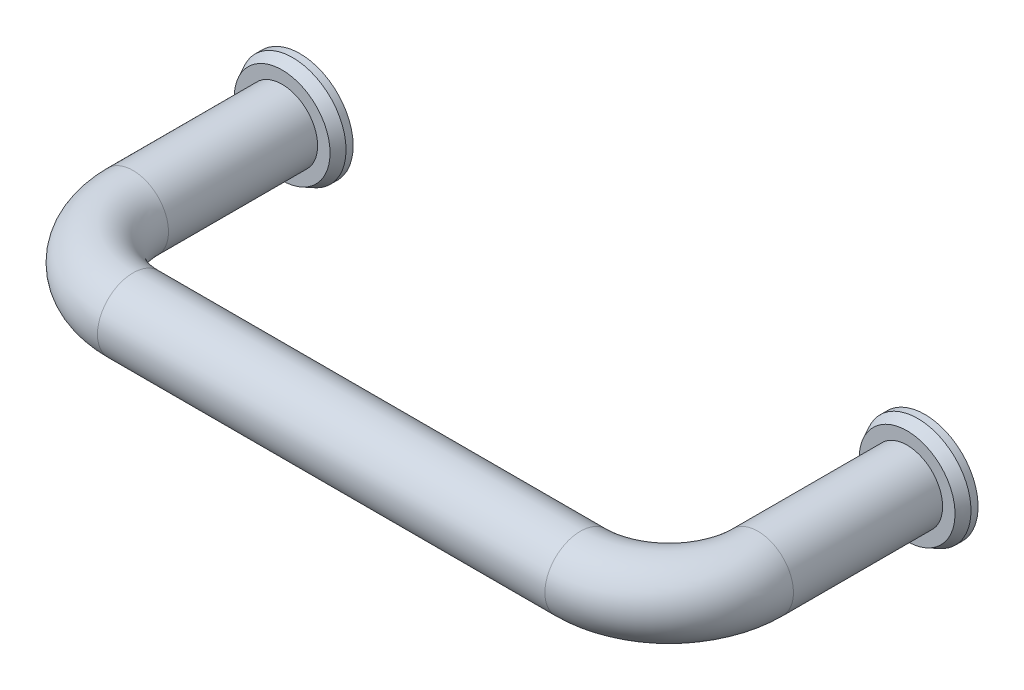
ISO-10303-21;
HEADER;
FILE_DESCRIPTION(('STEP AP214'),'2;1');
FILE_NAME('part.step','',(''),(''),'','','');
FILE_SCHEMA(('AUTOMOTIVE_DESIGN { 1 0 10303 214 1 1 1 1 }'));
ENDSEC;
DATA;
#1=APPLICATION_CONTEXT('core data for automotive mechanical design processes');
#2=APPLICATION_PROTOCOL_DEFINITION('international standard','automotive_design',2000,#1);
#3=PRODUCT_CONTEXT('',#1,'mechanical');
#4=PRODUCT('Part','Part','',(#3));
#5=PRODUCT_RELATED_PRODUCT_CATEGORY('part','',(#4));
#6=PRODUCT_DEFINITION_FORMATION('','',#4);
#7=PRODUCT_DEFINITION_CONTEXT('part definition',#1,'design');
#8=PRODUCT_DEFINITION('design','',#6,#7);
#9=PRODUCT_DEFINITION_SHAPE('','',#8);
#10=(LENGTH_UNIT() NAMED_UNIT(*) SI_UNIT(.MILLI.,.METRE.));
#11=(NAMED_UNIT(*) PLANE_ANGLE_UNIT() SI_UNIT($,.RADIAN.));
#12=(NAMED_UNIT(*) SI_UNIT($,.STERADIAN.) SOLID_ANGLE_UNIT());
#13=UNCERTAINTY_MEASURE_WITH_UNIT(LENGTH_MEASURE(1.E-05),#10,'distance_accuracy_value','');
#14=(GEOMETRIC_REPRESENTATION_CONTEXT(3) GLOBAL_UNCERTAINTY_ASSIGNED_CONTEXT((#13)) GLOBAL_UNIT_ASSIGNED_CONTEXT((#10,
#11,#12)) REPRESENTATION_CONTEXT('',''));
#15=CARTESIAN_POINT('',(0.,0.,0.));
#16=DIRECTION('',(0.,0.,1.));
#17=DIRECTION('',(1.,0.,0.));
#18=AXIS2_PLACEMENT_3D('',#15,#16,#17);
#19=CARTESIAN_POINT('',(0.,0.,0.));
#20=DIRECTION('',(0.,0.,-1.));
#21=DIRECTION('',(0.,1.,0.));
#22=AXIS2_PLACEMENT_3D('',#19,#20,#21);
#23=PLANE('',#22);
#24=CARTESIAN_POINT('',(0.,0.,0.));
#25=DIRECTION('',(0.,0.,1.));
#26=DIRECTION('',(1.,0.,0.));
#27=AXIS2_PLACEMENT_3D('',#24,#25,#26);
#28=CIRCLE('',#27,7.5);
#29=CARTESIAN_POINT('',(7.5,0.,0.));
#30=VERTEX_POINT('',#29);
#31=EDGE_CURVE('E56',#30,#30,#28,.T.);
#32=ORIENTED_EDGE('',*,*,#31,.F.);
#33=EDGE_LOOP('',(#32));
#34=FACE_BOUND('',#33,.T.);
#35=CARTESIAN_POINT('',(0.,0.,0.));
#36=DIRECTION('',(0.,0.,1.));
#37=DIRECTION('',(0.,-1.,0.));
#38=AXIS2_PLACEMENT_3D('',#35,#36,#37);
#39=CIRCLE('',#38,2.5);
#40=CARTESIAN_POINT('',(0.,-2.5,0.));
#41=VERTEX_POINT('',#40);
#42=EDGE_CURVE('E62',#41,#41,#39,.T.);
#43=ORIENTED_EDGE('',*,*,#42,.T.);
#44=EDGE_LOOP('',(#43));
#45=FACE_BOUND('',#44,.T.);
#46=ADVANCED_FACE('F12',(#34,#45),#23,.T.);
#47=CARTESIAN_POINT('',(0.,0.,23.5));
#48=DIRECTION('',(0.,0.,-1.));
#49=DIRECTION('',(0.,-1.,0.));
#50=AXIS2_PLACEMENT_3D('',#47,#48,#49);
#51=CYLINDRICAL_SURFACE('',#50,5.);
#52=CARTESIAN_POINT('',(0.,0.,23.5));
#53=DIRECTION('',(0.,0.,-1.));
#54=DIRECTION('',(0.,1.,0.));
#55=AXIS2_PLACEMENT_3D('',#52,#53,#54);
#56=CIRCLE('',#55,5.);
#57=CARTESIAN_POINT('',(-5.,0.,23.5));
#58=VERTEX_POINT('',#57);
#59=EDGE_CURVE('E20',#58,#58,#56,.T.);
#60=ORIENTED_EDGE('',*,*,#59,.T.);
#61=EDGE_LOOP('',(#60));
#62=FACE_BOUND('',#61,.T.);
#63=CARTESIAN_POINT('',(0.,0.,2.5));
#64=DIRECTION('',(0.,0.,-1.));
#65=DIRECTION('',(-1.,0.,0.));
#66=AXIS2_PLACEMENT_3D('',#63,#64,#65);
#67=CIRCLE('',#66,5.);
#68=CARTESIAN_POINT('',(-5.,0.,2.50000000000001));
#69=VERTEX_POINT('',#68);
#70=EDGE_CURVE('E16',#69,#69,#67,.F.);
#71=ORIENTED_EDGE('',*,*,#70,.T.);
#72=EDGE_LOOP('',(#71));
#73=FACE_BOUND('',#72,.T.);
#74=ADVANCED_FACE('F14',(#62,#73),#51,.T.);
#75=CARTESIAN_POINT('',(88.,0.,23.5));
#76=DIRECTION('',(0.,0.,-1.));
#77=DIRECTION('',(0.,-1.,0.));
#78=AXIS2_PLACEMENT_3D('',#75,#76,#77);
#79=CYLINDRICAL_SURFACE('',#78,5.);
#80=CARTESIAN_POINT('',(88.,0.,23.5));
#81=DIRECTION('',(0.,0.,1.));
#82=DIRECTION('',(0.,1.,0.));
#83=AXIS2_PLACEMENT_3D('',#80,#81,#82);
#84=CIRCLE('',#83,5.);
#85=CARTESIAN_POINT('',(93.,0.,23.5));
#86=VERTEX_POINT('',#85);
#87=EDGE_CURVE('E32',#86,#86,#84,.T.);
#88=ORIENTED_EDGE('',*,*,#87,.F.);
#89=EDGE_LOOP('',(#88));
#90=FACE_BOUND('',#89,.T.);
#91=CARTESIAN_POINT('',(88.,0.,2.5));
#92=DIRECTION('',(0.,0.,-1.));
#93=DIRECTION('',(-1.,0.,0.));
#94=AXIS2_PLACEMENT_3D('',#91,#92,#93);
#95=CIRCLE('',#94,5.);
#96=CARTESIAN_POINT('',(83.,0.,2.49999999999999));
#97=VERTEX_POINT('',#96);
#98=EDGE_CURVE('E8',#97,#97,#95,.T.);
#99=ORIENTED_EDGE('',*,*,#98,.F.);
#100=EDGE_LOOP('',(#99));
#101=FACE_BOUND('',#100,.T.);
#102=ADVANCED_FACE('F91',(#90,#101),#79,.T.);
#103=CARTESIAN_POINT('',(12.5,0.,23.5));
#104=DIRECTION('',(0.,-1.,0.));
#105=DIRECTION('',(1.,0.,0.));
#106=AXIS2_PLACEMENT_3D('',#103,#104,#105);
#107=TOROIDAL_SURFACE('',#106,12.5,5.);
#108=CARTESIAN_POINT('',(12.5,0.,36.));
#109=DIRECTION('',(-1.,0.,0.));
#110=DIRECTION('',(0.,1.,0.));
#111=AXIS2_PLACEMENT_3D('',#108,#109,#110);
#112=CIRCLE('',#111,5.);
#113=CARTESIAN_POINT('',(12.5,0.,41.));
#114=VERTEX_POINT('',#113);
#115=EDGE_CURVE('E24',#114,#114,#112,.T.);
#116=CARTESIAN_POINT('',(12.5,0.,23.5));
#117=DIRECTION('',(0.,-1.,0.));
#118=DIRECTION('',(1.,0.,0.));
#119=AXIS2_PLACEMENT_3D('',#116,#117,#118);
#120=CIRCLE('',#119,17.5);
#121=EDGE_CURVE('',#114,#58,#120,.T.);
#122=ORIENTED_EDGE('',*,*,#115,.T.);
#123=ORIENTED_EDGE('',*,*,#59,.F.);
#124=ORIENTED_EDGE('',*,*,#121,.T.);
#125=ORIENTED_EDGE('',*,*,#121,.F.);
#126=EDGE_LOOP('',(#122,#124,#123,#125));
#127=FACE_BOUND('',#126,.T.);
#128=ADVANCED_FACE('F100',(#127),#107,.T.);
#129=CARTESIAN_POINT('',(75.5,0.,36.));
#130=DIRECTION('',(-1.,0.,0.));
#131=DIRECTION('',(0.,-1.,0.));
#132=AXIS2_PLACEMENT_3D('',#129,#130,#131);
#133=CYLINDRICAL_SURFACE('',#132,5.);
#134=CARTESIAN_POINT('',(75.5,0.,36.));
#135=DIRECTION('',(-1.,0.,0.));
#136=DIRECTION('',(0.,1.,0.));
#137=AXIS2_PLACEMENT_3D('',#134,#135,#136);
#138=CIRCLE('',#137,5.);
#139=CARTESIAN_POINT('',(75.5,0.,41.));
#140=VERTEX_POINT('',#139);
#141=EDGE_CURVE('E29',#140,#140,#138,.T.);
#142=ORIENTED_EDGE('',*,*,#141,.T.);
#143=EDGE_LOOP('',(#142));
#144=FACE_BOUND('',#143,.T.);
#145=ORIENTED_EDGE('',*,*,#115,.F.);
#146=EDGE_LOOP('',(#145));
#147=FACE_BOUND('',#146,.T.);
#148=ADVANCED_FACE('F106',(#144,#147),#133,.T.);
#149=CARTESIAN_POINT('',(75.5,0.,23.5));
#150=DIRECTION('',(0.,-1.,0.));
#151=DIRECTION('',(1.,0.,0.));
#152=AXIS2_PLACEMENT_3D('',#149,#150,#151);
#153=TOROIDAL_SURFACE('',#152,12.5,5.);
#154=CARTESIAN_POINT('',(75.5,0.,23.5));
#155=DIRECTION('',(0.,-1.,0.));
#156=DIRECTION('',(1.,0.,0.));
#157=AXIS2_PLACEMENT_3D('',#154,#155,#156);
#158=CIRCLE('',#157,17.5);
#159=EDGE_CURVE('',#86,#140,#158,.T.);
#160=ORIENTED_EDGE('',*,*,#87,.T.);
#161=ORIENTED_EDGE('',*,*,#141,.F.);
#162=ORIENTED_EDGE('',*,*,#159,.T.);
#163=ORIENTED_EDGE('',*,*,#159,.F.);
#164=EDGE_LOOP('',(#160,#162,#161,#163));
#165=FACE_BOUND('',#164,.T.);
#166=ADVANCED_FACE('F102',(#165),#153,.T.);
#167=CARTESIAN_POINT('',(88.,0.,2.5));
#168=DIRECTION('',(0.,0.,-1.));
#169=DIRECTION('',(-1.,0.,0.));
#170=AXIS2_PLACEMENT_3D('',#167,#168,#169);
#171=PLANE('',#170);
#172=CARTESIAN_POINT('',(88.,0.,2.5));
#173=DIRECTION('',(0.,0.,-1.));
#174=DIRECTION('',(-1.,0.,0.));
#175=AXIS2_PLACEMENT_3D('',#172,#173,#174);
#176=CIRCLE('',#175,6.75);
#177=CARTESIAN_POINT('',(81.25,0.,2.49999999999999));
#178=VERTEX_POINT('',#177);
#179=EDGE_CURVE('E35',#178,#178,#176,.T.);
#180=ORIENTED_EDGE('',*,*,#179,.F.);
#181=EDGE_LOOP('',(#180));
#182=FACE_BOUND('',#181,.T.);
#183=ORIENTED_EDGE('',*,*,#98,.T.);
#184=EDGE_LOOP('',(#183));
#185=FACE_BOUND('',#184,.T.);
#186=ADVANCED_FACE('F105',(#182,#185),#171,.F.);
#187=CARTESIAN_POINT('',(88.,0.,2.5));
#188=DIRECTION('',(0.,0.,-1.));
#189=DIRECTION('',(-1.,0.,0.));
#190=AXIS2_PLACEMENT_3D('',#187,#188,#189);
#191=CONICAL_SURFACE('',#190,6.75,0.463647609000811);
#192=CARTESIAN_POINT('',(88.,0.,1.));
#193=DIRECTION('',(0.,0.,-1.));
#194=DIRECTION('',(-1.,0.,0.));
#195=AXIS2_PLACEMENT_3D('',#192,#193,#194);
#196=CIRCLE('',#195,7.5);
#197=CARTESIAN_POINT('',(80.5,0.,0.999999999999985));
#198=VERTEX_POINT('',#197);
#199=EDGE_CURVE('E38',#198,#198,#196,.T.);
#200=ORIENTED_EDGE('',*,*,#199,.F.);
#201=EDGE_LOOP('',(#200));
#202=FACE_BOUND('',#201,.T.);
#203=ORIENTED_EDGE('',*,*,#179,.T.);
#204=EDGE_LOOP('',(#203));
#205=FACE_BOUND('',#204,.T.);
#206=ADVANCED_FACE('F146',(#202,#205),#191,.T.);
#207=CARTESIAN_POINT('',(88.,0.,0.));
#208=DIRECTION('',(0.,0.,-1.));
#209=DIRECTION('',(-1.,0.,0.));
#210=AXIS2_PLACEMENT_3D('',#207,#208,#209);
#211=CYLINDRICAL_SURFACE('',#210,7.5);
#212=CARTESIAN_POINT('',(88.,0.,0.));
#213=DIRECTION('',(0.,0.,-1.));
#214=DIRECTION('',(-1.,0.,0.));
#215=AXIS2_PLACEMENT_3D('',#212,#213,#214);
#216=CIRCLE('',#215,7.5);
#217=CARTESIAN_POINT('',(80.5,0.,0.));
#218=VERTEX_POINT('',#217);
#219=EDGE_CURVE('E41',#218,#218,#216,.T.);
#220=ORIENTED_EDGE('',*,*,#219,.F.);
#221=EDGE_LOOP('',(#220));
#222=FACE_BOUND('',#221,.T.);
#223=ORIENTED_EDGE('',*,*,#199,.T.);
#224=EDGE_LOOP('',(#223));
#225=FACE_BOUND('',#224,.T.);
#226=ADVANCED_FACE('F143',(#222,#225),#211,.T.);
#227=CARTESIAN_POINT('',(88.,0.,0.));
#228=DIRECTION('',(0.,0.,1.));
#229=DIRECTION('',(0.,1.,0.));
#230=AXIS2_PLACEMENT_3D('',#227,#228,#229);
#231=PLANE('',#230);
#232=CARTESIAN_POINT('',(88.,0.,0.));
#233=DIRECTION('',(0.,0.,-1.));
#234=DIRECTION('',(0.,-1.,0.));
#235=AXIS2_PLACEMENT_3D('',#232,#233,#234);
#236=CIRCLE('',#235,2.5);
#237=CARTESIAN_POINT('',(88.,-2.5,0.));
#238=VERTEX_POINT('',#237);
#239=EDGE_CURVE('E47',#238,#238,#236,.T.);
#240=ORIENTED_EDGE('',*,*,#239,.F.);
#241=EDGE_LOOP('',(#240));
#242=FACE_BOUND('',#241,.T.);
#243=ORIENTED_EDGE('',*,*,#219,.T.);
#244=EDGE_LOOP('',(#243));
#245=FACE_BOUND('',#244,.T.);
#246=ADVANCED_FACE('F96',(#242,#245),#231,.F.);
#247=CARTESIAN_POINT('',(88.,0.,11.));
#248=DIRECTION('',(0.,0.,-1.));
#249=DIRECTION('',(0.,-1.,0.));
#250=AXIS2_PLACEMENT_3D('',#247,#248,#249);
#251=CYLINDRICAL_SURFACE('',#250,2.5);
#252=CARTESIAN_POINT('',(88.,0.,11.));
#253=DIRECTION('',(0.,0.,-1.));
#254=DIRECTION('',(0.,-1.,0.));
#255=AXIS2_PLACEMENT_3D('',#252,#253,#254);
#256=CIRCLE('',#255,2.5);
#257=CARTESIAN_POINT('',(88.,-2.5,11.));
#258=VERTEX_POINT('',#257);
#259=EDGE_CURVE('E44',#258,#258,#256,.T.);
#260=ORIENTED_EDGE('',*,*,#259,.F.);
#261=EDGE_LOOP('',(#260));
#262=FACE_BOUND('',#261,.T.);
#263=ORIENTED_EDGE('',*,*,#239,.T.);
#264=EDGE_LOOP('',(#263));
#265=FACE_BOUND('',#264,.T.);
#266=ADVANCED_FACE('F127',(#262,#265),#251,.F.);
#267=CARTESIAN_POINT('',(88.,0.,11.));
#268=DIRECTION('',(0.,0.,-1.));
#269=DIRECTION('',(0.,-1.,0.));
#270=AXIS2_PLACEMENT_3D('',#267,#268,#269);
#271=PLANE('',#270);
#272=ORIENTED_EDGE('',*,*,#259,.T.);
#273=EDGE_LOOP('',(#272));
#274=FACE_BOUND('',#273,.T.);
#275=ADVANCED_FACE('F125',(#274),#271,.T.);
#276=CARTESIAN_POINT('',(0.,0.,2.5));
#277=DIRECTION('',(0.,0.,-1.));
#278=DIRECTION('',(1.,0.,0.));
#279=AXIS2_PLACEMENT_3D('',#276,#277,#278);
#280=PLANE('',#279);
#281=ORIENTED_EDGE('',*,*,#70,.F.);
#282=EDGE_LOOP('',(#281));
#283=FACE_BOUND('',#282,.T.);
#284=CARTESIAN_POINT('',(0.,0.,2.5));
#285=DIRECTION('',(0.,0.,1.));
#286=DIRECTION('',(1.,0.,0.));
#287=AXIS2_PLACEMENT_3D('',#284,#285,#286);
#288=CIRCLE('',#287,6.75);
#289=CARTESIAN_POINT('',(6.75,0.,2.49999999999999));
#290=VERTEX_POINT('',#289);
#291=EDGE_CURVE('E50',#290,#290,#288,.T.);
#292=ORIENTED_EDGE('',*,*,#291,.T.);
#293=EDGE_LOOP('',(#292));
#294=FACE_BOUND('',#293,.T.);
#295=ADVANCED_FACE('F122',(#283,#294),#280,.F.);
#296=CARTESIAN_POINT('',(0.,0.,2.5));
#297=DIRECTION('',(0.,0.,-1.));
#298=DIRECTION('',(1.,0.,0.));
#299=AXIS2_PLACEMENT_3D('',#296,#297,#298);
#300=CONICAL_SURFACE('',#299,6.75,0.463647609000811);
#301=CARTESIAN_POINT('',(0.,0.,1.));
#302=DIRECTION('',(0.,0.,1.));
#303=DIRECTION('',(1.,0.,0.));
#304=AXIS2_PLACEMENT_3D('',#301,#302,#303);
#305=CIRCLE('',#304,7.5);
#306=CARTESIAN_POINT('',(7.5,0.,0.999999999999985));
#307=VERTEX_POINT('',#306);
#308=EDGE_CURVE('E53',#307,#307,#305,.T.);
#309=ORIENTED_EDGE('',*,*,#308,.T.);
#310=EDGE_LOOP('',(#309));
#311=FACE_BOUND('',#310,.T.);
#312=ORIENTED_EDGE('',*,*,#291,.F.);
#313=EDGE_LOOP('',(#312));
#314=FACE_BOUND('',#313,.T.);
#315=ADVANCED_FACE('F81',(#311,#314),#300,.T.);
#316=CARTESIAN_POINT('',(0.,0.,0.));
#317=DIRECTION('',(0.,0.,-1.));
#318=DIRECTION('',(1.,0.,0.));
#319=AXIS2_PLACEMENT_3D('',#316,#317,#318);
#320=CYLINDRICAL_SURFACE('',#319,7.5);
#321=ORIENTED_EDGE('',*,*,#31,.T.);
#322=EDGE_LOOP('',(#321));
#323=FACE_BOUND('',#322,.T.);
#324=ORIENTED_EDGE('',*,*,#308,.F.);
#325=EDGE_LOOP('',(#324));
#326=FACE_BOUND('',#325,.T.);
#327=ADVANCED_FACE('F70',(#323,#326),#320,.T.);
#328=CARTESIAN_POINT('',(0.,0.,11.));
#329=DIRECTION('',(0.,0.,-1.));
#330=DIRECTION('',(0.,-1.,0.));
#331=AXIS2_PLACEMENT_3D('',#328,#329,#330);
#332=CYLINDRICAL_SURFACE('',#331,2.5);
#333=CARTESIAN_POINT('',(0.,0.,11.));
#334=DIRECTION('',(0.,0.,1.));
#335=DIRECTION('',(0.,-1.,0.));
#336=AXIS2_PLACEMENT_3D('',#333,#334,#335);
#337=CIRCLE('',#336,2.5);
#338=CARTESIAN_POINT('',(0.,-2.5,11.));
#339=VERTEX_POINT('',#338);
#340=EDGE_CURVE('E59',#339,#339,#337,.T.);
#341=ORIENTED_EDGE('',*,*,#340,.T.);
#342=EDGE_LOOP('',(#341));
#343=FACE_BOUND('',#342,.T.);
#344=ORIENTED_EDGE('',*,*,#42,.F.);
#345=EDGE_LOOP('',(#344));
#346=FACE_BOUND('',#345,.T.);
#347=ADVANCED_FACE('F67',(#343,#346),#332,.F.);
#348=CARTESIAN_POINT('',(0.,0.,11.));
#349=DIRECTION('',(0.,0.,-1.));
#350=DIRECTION('',(0.,-1.,0.));
#351=AXIS2_PLACEMENT_3D('',#348,#349,#350);
#352=PLANE('',#351);
#353=ORIENTED_EDGE('',*,*,#340,.F.);
#354=EDGE_LOOP('',(#353));
#355=FACE_BOUND('',#354,.T.);
#356=ADVANCED_FACE('F69',(#355),#352,.T.);
#357=CLOSED_SHELL('',(#46,#74,#102,#128,#148,#166,#186,#206,#226,#246,#266,#275,#295,#315,#327,
#347,#356));
#358=MANIFOLD_SOLID_BREP('B1',#357);
#359=ADVANCED_BREP_SHAPE_REPRESENTATION('',(#18,#358),#14);
#360=SHAPE_DEFINITION_REPRESENTATION(#9,#359);
ENDSEC;
END-ISO-10303-21;
